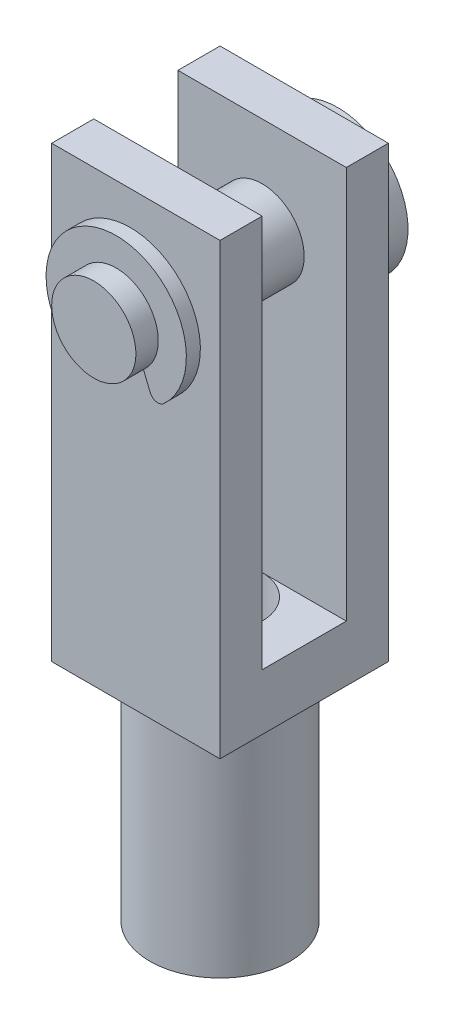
ISO-10303-21;
HEADER;
FILE_DESCRIPTION(('STEP AP214'),'2;1');
FILE_NAME('part.step','',(''),(''),'','','');
FILE_SCHEMA(('AUTOMOTIVE_DESIGN { 1 0 10303 214 1 1 1 1 }'));
ENDSEC;
DATA;
#1=APPLICATION_CONTEXT('core data for automotive mechanical design processes');
#2=APPLICATION_PROTOCOL_DEFINITION('international standard','automotive_design',2000,#1);
#3=PRODUCT_CONTEXT('',#1,'mechanical');
#4=PRODUCT('Part','Part','',(#3));
#5=PRODUCT_RELATED_PRODUCT_CATEGORY('part','',(#4));
#6=PRODUCT_DEFINITION_FORMATION('','',#4);
#7=PRODUCT_DEFINITION_CONTEXT('part definition',#1,'design');
#8=PRODUCT_DEFINITION('design','',#6,#7);
#9=PRODUCT_DEFINITION_SHAPE('','',#8);
#10=(LENGTH_UNIT() NAMED_UNIT(*) SI_UNIT(.MILLI.,.METRE.));
#11=(NAMED_UNIT(*) PLANE_ANGLE_UNIT() SI_UNIT($,.RADIAN.));
#12=(NAMED_UNIT(*) SI_UNIT($,.STERADIAN.) SOLID_ANGLE_UNIT());
#13=UNCERTAINTY_MEASURE_WITH_UNIT(LENGTH_MEASURE(1.E-05),#10,'distance_accuracy_value','');
#14=(GEOMETRIC_REPRESENTATION_CONTEXT(3) GLOBAL_UNCERTAINTY_ASSIGNED_CONTEXT((#13)) GLOBAL_UNIT_ASSIGNED_CONTEXT((#10,
#11,#12)) REPRESENTATION_CONTEXT('',''));
#15=CARTESIAN_POINT('',(0.,0.,0.));
#16=DIRECTION('',(0.,0.,1.));
#17=DIRECTION('',(1.,0.,0.));
#18=AXIS2_PLACEMENT_3D('',#15,#16,#17);
#19=CARTESIAN_POINT('',(1.48650456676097,10.8781787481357,3.7));
#20=DIRECTION('',(0.,0.,-1.));
#21=DIRECTION('',(-1.,0.,0.));
#22=AXIS2_PLACEMENT_3D('',#19,#20,#21);
#23=CYLINDRICAL_SURFACE('',#22,0.3);
#24=CARTESIAN_POINT('',(1.48650456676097,10.8781787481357,3.2));
#25=DIRECTION('',(0.,0.,1.));
#26=DIRECTION('',(1.,0.,0.));
#27=AXIS2_PLACEMENT_3D('',#24,#25,#26);
#28=CIRCLE('',#27,0.3);
#29=CARTESIAN_POINT('',(1.20843535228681,10.7655842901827,3.2));
#30=VERTEX_POINT('',#29);
#31=CARTESIAN_POINT('',(1.68920973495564,10.6570213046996,3.2));
#32=VERTEX_POINT('',#31);
#33=EDGE_CURVE('E127',#30,#32,#28,.T.);
#34=ORIENTED_EDGE('',*,*,#33,.T.);
#35=DIRECTION('',(0.,0.,-1.));
#36=VECTOR('',#35,1.);
#37=CARTESIAN_POINT('',(1.68920973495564,10.6570213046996,3.7));
#38=LINE('',#37,#36);
#39=CARTESIAN_POINT('',(1.68920973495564,10.6570213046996,3.7));
#40=VERTEX_POINT('',#39);
#41=EDGE_CURVE('E12',#40,#32,#38,.T.);
#42=ORIENTED_EDGE('',*,*,#41,.F.);
#43=CARTESIAN_POINT('',(1.48650456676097,10.8781787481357,3.7));
#44=DIRECTION('',(0.,0.,1.));
#45=DIRECTION('',(1.,0.,0.));
#46=AXIS2_PLACEMENT_3D('',#43,#44,#45);
#47=CIRCLE('',#46,0.3);
#48=CARTESIAN_POINT('',(1.20843535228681,10.7655842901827,3.7));
#49=VERTEX_POINT('',#48);
#50=EDGE_CURVE('E137',#49,#40,#47,.T.);
#51=ORIENTED_EDGE('',*,*,#50,.F.);
#52=DIRECTION('',(0.,0.,-1.));
#53=VECTOR('',#52,1.);
#54=CARTESIAN_POINT('',(1.20843535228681,10.7655842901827,3.7));
#55=LINE('',#54,#53);
#56=EDGE_CURVE('E123',#49,#30,#55,.T.);
#57=ORIENTED_EDGE('',*,*,#56,.T.);
#58=EDGE_LOOP('',(#34,#42,#51,#57));
#59=FACE_BOUND('',#58,.T.);
#60=ADVANCED_FACE('F43',(#59),#23,.T.);
#61=CARTESIAN_POINT('',(0.,12.5,3.7));
#62=DIRECTION('',(0.,0.,-1.));
#63=DIRECTION('',(-1.,0.,0.));
#64=AXIS2_PLACEMENT_3D('',#61,#62,#63);
#65=CYLINDRICAL_SURFACE('',#64,2.5);
#66=CARTESIAN_POINT('',(0.,12.5,3.2));
#67=DIRECTION('',(0.,0.,1.));
#68=DIRECTION('',(1.,0.,0.));
#69=AXIS2_PLACEMENT_3D('',#66,#67,#68);
#70=CIRCLE('',#69,2.5);
#71=CARTESIAN_POINT('',(-1.68920973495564,10.6570213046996,3.2));
#72=VERTEX_POINT('',#71);
#73=EDGE_CURVE('E130',#32,#72,#70,.T.);
#74=ORIENTED_EDGE('',*,*,#73,.T.);
#75=DIRECTION('',(0.,0.,-1.));
#76=VECTOR('',#75,1.);
#77=CARTESIAN_POINT('',(-1.68920973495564,10.6570213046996,3.7));
#78=LINE('',#77,#76);
#79=CARTESIAN_POINT('',(-1.68920973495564,10.6570213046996,3.7));
#80=VERTEX_POINT('',#79);
#81=EDGE_CURVE('E51',#80,#72,#78,.T.);
#82=ORIENTED_EDGE('',*,*,#81,.F.);
#83=CARTESIAN_POINT('',(0.,12.5,3.7));
#84=DIRECTION('',(0.,0.,1.));
#85=DIRECTION('',(1.,0.,0.));
#86=AXIS2_PLACEMENT_3D('',#83,#84,#85);
#87=CIRCLE('',#86,2.5);
#88=EDGE_CURVE('E96',#40,#80,#87,.T.);
#89=ORIENTED_EDGE('',*,*,#88,.F.);
#90=ORIENTED_EDGE('',*,*,#41,.T.);
#91=EDGE_LOOP('',(#74,#82,#89,#90));
#92=FACE_BOUND('',#91,.T.);
#93=ADVANCED_FACE('F161',(#92),#65,.T.);
#94=CARTESIAN_POINT('',(-1.48650456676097,10.8781787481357,3.7));
#95=DIRECTION('',(0.,0.,-1.));
#96=DIRECTION('',(-1.,0.,0.));
#97=AXIS2_PLACEMENT_3D('',#94,#95,#96);
#98=CYLINDRICAL_SURFACE('',#97,0.3);
#99=CARTESIAN_POINT('',(-1.48650456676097,10.8781787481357,3.2));
#100=DIRECTION('',(0.,0.,1.));
#101=DIRECTION('',(-1.,0.,0.));
#102=AXIS2_PLACEMENT_3D('',#99,#100,#101);
#103=CIRCLE('',#102,0.3);
#104=CARTESIAN_POINT('',(-1.2084353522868,10.7655842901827,3.2));
#105=VERTEX_POINT('',#104);
#106=EDGE_CURVE('E132',#72,#105,#103,.T.);
#107=ORIENTED_EDGE('',*,*,#106,.T.);
#108=DIRECTION('',(0.,0.,-1.));
#109=VECTOR('',#108,1.);
#110=CARTESIAN_POINT('',(-1.2084353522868,10.7655842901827,3.7));
#111=LINE('',#110,#109);
#112=CARTESIAN_POINT('',(-1.2084353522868,10.7655842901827,3.7));
#113=VERTEX_POINT('',#112);
#114=EDGE_CURVE('E118',#113,#105,#111,.T.);
#115=ORIENTED_EDGE('',*,*,#114,.F.);
#116=CARTESIAN_POINT('',(-1.48650456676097,10.8781787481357,3.7));
#117=DIRECTION('',(0.,0.,1.));
#118=DIRECTION('',(-1.,0.,0.));
#119=AXIS2_PLACEMENT_3D('',#116,#117,#118);
#120=CIRCLE('',#119,0.3);
#121=EDGE_CURVE('E109',#80,#113,#120,.T.);
#122=ORIENTED_EDGE('',*,*,#121,.F.);
#123=ORIENTED_EDGE('',*,*,#81,.T.);
#124=EDGE_LOOP('',(#107,#115,#122,#123));
#125=FACE_BOUND('',#124,.T.);
#126=ADVANCED_FACE('F143',(#125),#98,.T.);
#127=CARTESIAN_POINT('',(-0.86969590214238,11.6021531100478,3.7));
#128=DIRECTION('',(-0.92689738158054,0.375314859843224,0.));
#129=DIRECTION('',(-0.375314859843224,-0.92689738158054,0.));
#130=AXIS2_PLACEMENT_3D('',#127,#128,#129);
#131=PLANE('',#130);
#132=DIRECTION('',(0.375314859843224,0.92689738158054,0.));
#133=VECTOR('',#132,1.);
#134=CARTESIAN_POINT('',(-0.86969590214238,11.6021531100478,3.2));
#135=LINE('',#134,#133);
#136=CARTESIAN_POINT('',(-0.86969590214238,11.6021531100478,3.2));
#137=VERTEX_POINT('',#136);
#138=EDGE_CURVE('E117',#105,#137,#135,.T.);
#139=ORIENTED_EDGE('',*,*,#138,.T.);
#140=DIRECTION('',(0.,0.,-1.));
#141=VECTOR('',#140,1.);
#142=CARTESIAN_POINT('',(-0.86969590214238,11.6021531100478,3.7));
#143=LINE('',#142,#141);
#144=CARTESIAN_POINT('',(-0.86969590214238,11.6021531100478,3.7));
#145=VERTEX_POINT('',#144);
#146=EDGE_CURVE('E114',#145,#137,#143,.T.);
#147=ORIENTED_EDGE('',*,*,#146,.F.);
#148=DIRECTION('',(0.375314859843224,0.92689738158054,0.));
#149=VECTOR('',#148,1.);
#150=CARTESIAN_POINT('',(-0.86969590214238,11.6021531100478,3.7));
#151=LINE('',#150,#149);
#152=EDGE_CURVE('E103',#113,#145,#151,.T.);
#153=ORIENTED_EDGE('',*,*,#152,.F.);
#154=ORIENTED_EDGE('',*,*,#114,.T.);
#155=EDGE_LOOP('',(#139,#147,#153,#154));
#156=FACE_BOUND('',#155,.T.);
#157=ADVANCED_FACE('F115',(#156),#131,.F.);
#158=CARTESIAN_POINT('',(0.,12.5,3.7));
#159=DIRECTION('',(0.,0.,-1.));
#160=DIRECTION('',(-1.,0.,0.));
#161=AXIS2_PLACEMENT_3D('',#158,#159,#160);
#162=CYLINDRICAL_SURFACE('',#161,1.25);
#163=CARTESIAN_POINT('',(0.,12.5,3.2));
#164=DIRECTION('',(0.,0.,-1.));
#165=DIRECTION('',(1.,0.,0.));
#166=AXIS2_PLACEMENT_3D('',#163,#164,#165);
#167=CIRCLE('',#166,1.25);
#168=CARTESIAN_POINT('',(0.86969590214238,11.6021531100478,3.2));
#169=VERTEX_POINT('',#168);
#170=EDGE_CURVE('E82',#137,#169,#167,.T.);
#171=ORIENTED_EDGE('',*,*,#170,.T.);
#172=DIRECTION('',(0.,0.,-1.));
#173=VECTOR('',#172,1.);
#174=CARTESIAN_POINT('',(0.86969590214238,11.6021531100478,3.7));
#175=LINE('',#174,#173);
#176=CARTESIAN_POINT('',(0.86969590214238,11.6021531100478,3.7));
#177=VERTEX_POINT('',#176);
#178=EDGE_CURVE('E119',#177,#169,#175,.T.);
#179=ORIENTED_EDGE('',*,*,#178,.F.);
#180=CARTESIAN_POINT('',(0.,12.5,3.7));
#181=DIRECTION('',(0.,0.,-1.));
#182=DIRECTION('',(1.,0.,0.));
#183=AXIS2_PLACEMENT_3D('',#180,#181,#182);
#184=CIRCLE('',#183,1.25);
#185=EDGE_CURVE('E107',#145,#177,#184,.T.);
#186=ORIENTED_EDGE('',*,*,#185,.F.);
#187=ORIENTED_EDGE('',*,*,#146,.T.);
#188=EDGE_LOOP('',(#171,#179,#186,#187));
#189=FACE_BOUND('',#188,.T.);
#190=ADVANCED_FACE('F121',(#189),#162,.F.);
#191=CARTESIAN_POINT('',(0.86969590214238,11.6021531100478,3.7));
#192=DIRECTION('',(0.92689738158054,0.375314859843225,0.));
#193=DIRECTION('',(-0.375314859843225,0.92689738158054,0.));
#194=AXIS2_PLACEMENT_3D('',#191,#192,#193);
#195=PLANE('',#194);
#196=DIRECTION('',(0.375314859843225,-0.92689738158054,0.));
#197=VECTOR('',#196,1.);
#198=CARTESIAN_POINT('',(0.86969590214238,11.6021531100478,3.2));
#199=LINE('',#198,#197);
#200=EDGE_CURVE('E88',#169,#30,#199,.T.);
#201=ORIENTED_EDGE('',*,*,#200,.T.);
#202=ORIENTED_EDGE('',*,*,#56,.F.);
#203=DIRECTION('',(0.375314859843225,-0.92689738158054,0.));
#204=VECTOR('',#203,1.);
#205=CARTESIAN_POINT('',(0.86969590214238,11.6021531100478,3.7));
#206=LINE('',#205,#204);
#207=EDGE_CURVE('E59',#177,#49,#206,.T.);
#208=ORIENTED_EDGE('',*,*,#207,.F.);
#209=ORIENTED_EDGE('',*,*,#178,.T.);
#210=EDGE_LOOP('',(#201,#202,#208,#209));
#211=FACE_BOUND('',#210,.T.);
#212=ADVANCED_FACE('F150',(#211),#195,.F.);
#213=CARTESIAN_POINT('',(1.48650456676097,10.8781787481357,3.7));
#214=DIRECTION('',(0.,0.,1.));
#215=DIRECTION('',(1.,0.,0.));
#216=AXIS2_PLACEMENT_3D('',#213,#214,#215);
#217=PLANE('',#216);
#218=ORIENTED_EDGE('',*,*,#50,.T.);
#219=ORIENTED_EDGE('',*,*,#88,.T.);
#220=ORIENTED_EDGE('',*,*,#121,.T.);
#221=ORIENTED_EDGE('',*,*,#152,.T.);
#222=ORIENTED_EDGE('',*,*,#185,.T.);
#223=ORIENTED_EDGE('',*,*,#207,.T.);
#224=EDGE_LOOP('',(#218,#219,#220,#221,#222,#223));
#225=FACE_BOUND('',#224,.T.);
#226=ADVANCED_FACE('F105',(#225),#217,.T.);
#227=CARTESIAN_POINT('',(1.48650456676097,10.8781787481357,3.2));
#228=DIRECTION('',(0.,0.,1.));
#229=DIRECTION('',(1.,0.,0.));
#230=AXIS2_PLACEMENT_3D('',#227,#228,#229);
#231=PLANE('',#230);
#232=ORIENTED_EDGE('',*,*,#33,.F.);
#233=ORIENTED_EDGE('',*,*,#200,.F.);
#234=ORIENTED_EDGE('',*,*,#170,.F.);
#235=ORIENTED_EDGE('',*,*,#138,.F.);
#236=ORIENTED_EDGE('',*,*,#106,.F.);
#237=ORIENTED_EDGE('',*,*,#73,.F.);
#238=EDGE_LOOP('',(#232,#233,#234,#235,#236,#237));
#239=FACE_BOUND('',#238,.T.);
#240=ADVANCED_FACE('F146',(#239),#231,.F.);
#241=CLOSED_SHELL('',(#60,#93,#126,#157,#190,#212,#226,#240));
#242=MANIFOLD_SOLID_BREP('B2',#241);
#243=CARTESIAN_POINT('',(0.,12.5,4.5));
#244=DIRECTION('',(0.,0.,-1.));
#245=DIRECTION('',(-1.,0.,0.));
#246=AXIS2_PLACEMENT_3D('',#243,#244,#245);
#247=CYLINDRICAL_SURFACE('',#246,1.5);
#248=CARTESIAN_POINT('',(0.,12.5,4.5));
#249=DIRECTION('',(0.,0.,-1.));
#250=DIRECTION('',(-1.,0.,0.));
#251=AXIS2_PLACEMENT_3D('',#248,#249,#250);
#252=CIRCLE('',#251,1.5);
#253=CARTESIAN_POINT('',(-1.5,12.5,4.5));
#254=VERTEX_POINT('',#253);
#255=EDGE_CURVE('E42',#254,#254,#252,.T.);
#256=ORIENTED_EDGE('',*,*,#255,.T.);
#257=EDGE_LOOP('',(#256));
#258=FACE_BOUND('',#257,.T.);
#259=CARTESIAN_POINT('',(0.,12.5,-3.));
#260=DIRECTION('',(0.,0.,-1.));
#261=DIRECTION('',(-1.,0.,0.));
#262=AXIS2_PLACEMENT_3D('',#259,#260,#261);
#263=CIRCLE('',#262,1.5);
#264=CARTESIAN_POINT('',(-1.5,12.5,-3.));
#265=VERTEX_POINT('',#264);
#266=EDGE_CURVE('E230',#265,#265,#263,.T.);
#267=ORIENTED_EDGE('',*,*,#266,.F.);
#268=EDGE_LOOP('',(#267));
#269=FACE_BOUND('',#268,.T.);
#270=ADVANCED_FACE('F227',(#258,#269),#247,.T.);
#271=CARTESIAN_POINT('',(0.,12.5,4.5));
#272=DIRECTION('',(0.,0.,-1.));
#273=DIRECTION('',(-1.,0.,0.));
#274=AXIS2_PLACEMENT_3D('',#271,#272,#273);
#275=PLANE('',#274);
#276=ORIENTED_EDGE('',*,*,#255,.F.);
#277=EDGE_LOOP('',(#276));
#278=FACE_BOUND('',#277,.T.);
#279=ADVANCED_FACE('F250',(#278),#275,.F.);
#280=CARTESIAN_POINT('',(0.,12.5,-4.2));
#281=DIRECTION('',(0.,0.,1.));
#282=DIRECTION('',(1.,0.,0.));
#283=AXIS2_PLACEMENT_3D('',#280,#281,#282);
#284=CYLINDRICAL_SURFACE('',#283,2.5);
#285=CARTESIAN_POINT('',(0.,12.5,-4.2));
#286=DIRECTION('',(0.,0.,-1.));
#287=DIRECTION('',(-1.,0.,0.));
#288=AXIS2_PLACEMENT_3D('',#285,#286,#287);
#289=CIRCLE('',#288,2.5);
#290=CARTESIAN_POINT('',(-2.5,12.5,-4.2));
#291=VERTEX_POINT('',#290);
#292=EDGE_CURVE('E237',#291,#291,#289,.T.);
#293=ORIENTED_EDGE('',*,*,#292,.F.);
#294=EDGE_LOOP('',(#293));
#295=FACE_BOUND('',#294,.T.);
#296=CARTESIAN_POINT('',(0.,12.5,-3.));
#297=DIRECTION('',(0.,0.,-1.));
#298=DIRECTION('',(-1.,0.,0.));
#299=AXIS2_PLACEMENT_3D('',#296,#297,#298);
#300=CIRCLE('',#299,2.5);
#301=CARTESIAN_POINT('',(-2.5,12.5,-3.));
#302=VERTEX_POINT('',#301);
#303=EDGE_CURVE('E239',#302,#302,#300,.T.);
#304=ORIENTED_EDGE('',*,*,#303,.T.);
#305=EDGE_LOOP('',(#304));
#306=FACE_BOUND('',#305,.T.);
#307=ADVANCED_FACE('F247',(#295,#306),#284,.T.);
#308=CARTESIAN_POINT('',(0.,12.5,-4.2));
#309=DIRECTION('',(0.,0.,-1.));
#310=DIRECTION('',(-1.,0.,0.));
#311=AXIS2_PLACEMENT_3D('',#308,#309,#310);
#312=PLANE('',#311);
#313=ORIENTED_EDGE('',*,*,#292,.T.);
#314=EDGE_LOOP('',(#313));
#315=FACE_BOUND('',#314,.T.);
#316=ADVANCED_FACE('F245',(#315),#312,.T.);
#317=CARTESIAN_POINT('',(0.,12.5,-3.));
#318=DIRECTION('',(0.,0.,-1.));
#319=DIRECTION('',(-1.,0.,0.));
#320=AXIS2_PLACEMENT_3D('',#317,#318,#319);
#321=PLANE('',#320);
#322=ORIENTED_EDGE('',*,*,#266,.T.);
#323=EDGE_LOOP('',(#322));
#324=FACE_BOUND('',#323,.T.);
#325=ORIENTED_EDGE('',*,*,#303,.F.);
#326=EDGE_LOOP('',(#325));
#327=FACE_BOUND('',#326,.T.);
#328=ADVANCED_FACE('F254',(#324,#327),#321,.F.);
#329=CLOSED_SHELL('',(#270,#279,#307,#316,#328));
#330=MANIFOLD_SOLID_BREP('B6',#329);
#331=CARTESIAN_POINT('',(-3.,2.,1.5));
#332=DIRECTION('',(0.,-1.,0.));
#333=DIRECTION('',(0.,0.,-1.));
#334=AXIS2_PLACEMENT_3D('',#331,#332,#333);
#335=PLANE('',#334);
#336=DIRECTION('',(1.,0.,0.));
#337=VECTOR('',#336,1.);
#338=CARTESIAN_POINT('',(-3.,2.,-1.5));
#339=LINE('',#338,#337);
#340=CARTESIAN_POINT('',(0.,2.,-1.5));
#341=VERTEX_POINT('',#340);
#342=CARTESIAN_POINT('',(3.,2.,-1.5));
#343=VERTEX_POINT('',#342);
#344=EDGE_CURVE('E376',#341,#343,#339,.T.);
#345=ORIENTED_EDGE('',*,*,#344,.F.);
#346=CARTESIAN_POINT('',(0.,2.,0.));
#347=DIRECTION('',(0.,-1.,0.));
#348=DIRECTION('',(0.,0.,-1.));
#349=AXIS2_PLACEMENT_3D('',#346,#347,#348);
#350=CIRCLE('',#349,1.5);
#351=CARTESIAN_POINT('',(0.,2.,1.5));
#352=VERTEX_POINT('',#351);
#353=EDGE_CURVE('E225',#341,#352,#350,.T.);
#354=ORIENTED_EDGE('',*,*,#353,.T.);
#355=DIRECTION('',(1.,0.,0.));
#356=VECTOR('',#355,1.);
#357=CARTESIAN_POINT('',(-3.,2.,1.5));
#358=LINE('',#357,#356);
#359=CARTESIAN_POINT('',(3.,2.,1.5));
#360=VERTEX_POINT('',#359);
#361=EDGE_CURVE('E374',#352,#360,#358,.T.);
#362=ORIENTED_EDGE('',*,*,#361,.T.);
#363=DIRECTION('',(0.,0.,-1.));
#364=VECTOR('',#363,1.);
#365=CARTESIAN_POINT('',(3.,2.,1.5));
#366=LINE('',#365,#364);
#367=EDGE_CURVE('E455',#360,#343,#366,.T.);
#368=ORIENTED_EDGE('',*,*,#367,.T.);
#369=EDGE_LOOP('',(#345,#354,#362,#368));
#370=FACE_BOUND('',#369,.T.);
#371=ADVANCED_FACE('F297',(#370),#335,.F.);
#372=CARTESIAN_POINT('',(0.,16.,0.));
#373=DIRECTION('',(0.,1.,0.));
#374=DIRECTION('',(0.,0.,1.));
#375=AXIS2_PLACEMENT_3D('',#372,#373,#374);
#376=PLANE('',#375);
#377=DIRECTION('',(1.,0.,0.));
#378=VECTOR('',#377,1.);
#379=CARTESIAN_POINT('',(-3.,16.,1.5));
#380=LINE('',#379,#378);
#381=CARTESIAN_POINT('',(-3.,16.,1.5));
#382=VERTEX_POINT('',#381);
#383=CARTESIAN_POINT('',(3.,16.,1.5));
#384=VERTEX_POINT('',#383);
#385=EDGE_CURVE('E399',#382,#384,#380,.T.);
#386=ORIENTED_EDGE('',*,*,#385,.F.);
#387=DIRECTION('',(0.,0.,1.));
#388=VECTOR('',#387,1.);
#389=CARTESIAN_POINT('',(-3.,16.,-3.));
#390=LINE('',#389,#388);
#391=CARTESIAN_POINT('',(-3.,16.,3.));
#392=VERTEX_POINT('',#391);
#393=EDGE_CURVE('E406',#382,#392,#390,.T.);
#394=ORIENTED_EDGE('',*,*,#393,.T.);
#395=DIRECTION('',(1.,0.,0.));
#396=VECTOR('',#395,1.);
#397=CARTESIAN_POINT('',(-3.,16.,3.));
#398=LINE('',#397,#396);
#399=CARTESIAN_POINT('',(3.,16.,3.));
#400=VERTEX_POINT('',#399);
#401=EDGE_CURVE('E410',#392,#400,#398,.T.);
#402=ORIENTED_EDGE('',*,*,#401,.T.);
#403=DIRECTION('',(0.,0.,-1.));
#404=VECTOR('',#403,1.);
#405=CARTESIAN_POINT('',(3.,16.,-3.));
#406=LINE('',#405,#404);
#407=EDGE_CURVE('E400',#400,#384,#406,.T.);
#408=ORIENTED_EDGE('',*,*,#407,.T.);
#409=EDGE_LOOP('',(#386,#394,#402,#408));
#410=FACE_BOUND('',#409,.T.);
#411=ADVANCED_FACE('F470',(#410),#376,.T.);
#412=CARTESIAN_POINT('',(0.,0.,0.));
#413=DIRECTION('',(0.,1.,0.));
#414=DIRECTION('',(0.,0.,1.));
#415=AXIS2_PLACEMENT_3D('',#412,#413,#414);
#416=PLANE('',#415);
#417=DIRECTION('',(0.,0.,-1.));
#418=VECTOR('',#417,1.);
#419=CARTESIAN_POINT('',(3.,0.,-3.));
#420=LINE('',#419,#418);
#421=CARTESIAN_POINT('',(3.,0.,3.));
#422=VERTEX_POINT('',#421);
#423=CARTESIAN_POINT('',(3.,0.,-3.));
#424=VERTEX_POINT('',#423);
#425=EDGE_CURVE('E398',#422,#424,#420,.T.);
#426=ORIENTED_EDGE('',*,*,#425,.F.);
#427=DIRECTION('',(1.,0.,0.));
#428=VECTOR('',#427,1.);
#429=CARTESIAN_POINT('',(-3.,0.,3.));
#430=LINE('',#429,#428);
#431=CARTESIAN_POINT('',(-3.,0.,3.));
#432=VERTEX_POINT('',#431);
#433=EDGE_CURVE('E419',#432,#422,#430,.T.);
#434=ORIENTED_EDGE('',*,*,#433,.F.);
#435=DIRECTION('',(0.,0.,1.));
#436=VECTOR('',#435,1.);
#437=CARTESIAN_POINT('',(-3.,0.,-3.));
#438=LINE('',#437,#436);
#439=CARTESIAN_POINT('',(-3.,0.,-3.));
#440=VERTEX_POINT('',#439);
#441=EDGE_CURVE('E417',#440,#432,#438,.T.);
#442=ORIENTED_EDGE('',*,*,#441,.F.);
#443=DIRECTION('',(-1.,0.,0.));
#444=VECTOR('',#443,1.);
#445=CARTESIAN_POINT('',(-3.,0.,-3.));
#446=LINE('',#445,#444);
#447=EDGE_CURVE('E415',#424,#440,#446,.T.);
#448=ORIENTED_EDGE('',*,*,#447,.F.);
#449=EDGE_LOOP('',(#426,#434,#442,#448));
#450=FACE_BOUND('',#449,.T.);
#451=CARTESIAN_POINT('',(0.,0.,0.));
#452=DIRECTION('',(0.,1.,0.));
#453=DIRECTION('',(0.,0.,1.));
#454=AXIS2_PLACEMENT_3D('',#451,#452,#453);
#455=CIRCLE('',#454,2.5);
#456=CARTESIAN_POINT('',(0.,0.,2.5));
#457=VERTEX_POINT('',#456);
#458=EDGE_CURVE('E305',#457,#457,#455,.F.);
#459=ORIENTED_EDGE('',*,*,#458,.F.);
#460=EDGE_LOOP('',(#459));
#461=FACE_BOUND('',#460,.T.);
#462=ADVANCED_FACE('F485',(#450,#461),#416,.F.);
#463=CARTESIAN_POINT('',(3.,16.,-3.));
#464=DIRECTION('',(-1.,0.,0.));
#465=DIRECTION('',(0.,0.,1.));
#466=AXIS2_PLACEMENT_3D('',#463,#464,#465);
#467=PLANE('',#466);
#468=ORIENTED_EDGE('',*,*,#367,.F.);
#469=DIRECTION('',(0.,-1.,0.));
#470=VECTOR('',#469,1.);
#471=CARTESIAN_POINT('',(3.,16.,1.5));
#472=LINE('',#471,#470);
#473=EDGE_CURVE('E383',#384,#360,#472,.T.);
#474=ORIENTED_EDGE('',*,*,#473,.F.);
#475=ORIENTED_EDGE('',*,*,#407,.F.);
#476=DIRECTION('',(0.,-1.,0.));
#477=VECTOR('',#476,1.);
#478=CARTESIAN_POINT('',(3.,16.,3.));
#479=LINE('',#478,#477);
#480=EDGE_CURVE('E412',#400,#422,#479,.T.);
#481=ORIENTED_EDGE('',*,*,#480,.T.);
#482=ORIENTED_EDGE('',*,*,#425,.T.);
#483=DIRECTION('',(0.,-1.,0.));
#484=VECTOR('',#483,1.);
#485=CARTESIAN_POINT('',(3.,16.,-3.));
#486=LINE('',#485,#484);
#487=CARTESIAN_POINT('',(3.,16.,-3.));
#488=VERTEX_POINT('',#487);
#489=EDGE_CURVE('E429',#488,#424,#486,.T.);
#490=ORIENTED_EDGE('',*,*,#489,.F.);
#491=CARTESIAN_POINT('',(3.,16.,-1.5));
#492=VERTEX_POINT('',#491);
#493=EDGE_CURVE('E404',#492,#488,#406,.T.);
#494=ORIENTED_EDGE('',*,*,#493,.F.);
#495=DIRECTION('',(0.,1.,0.));
#496=VECTOR('',#495,1.);
#497=CARTESIAN_POINT('',(3.,16.,-1.5));
#498=LINE('',#497,#496);
#499=EDGE_CURVE('E317',#343,#492,#498,.T.);
#500=ORIENTED_EDGE('',*,*,#499,.F.);
#501=EDGE_LOOP('',(#468,#474,#475,#481,#482,#490,#494,#500));
#502=FACE_BOUND('',#501,.T.);
#503=ADVANCED_FACE('F299',(#502),#467,.F.);
#504=CARTESIAN_POINT('',(-3.,16.,-3.));
#505=DIRECTION('',(0.,0.,1.));
#506=DIRECTION('',(1.,0.,0.));
#507=AXIS2_PLACEMENT_3D('',#504,#505,#506);
#508=PLANE('',#507);
#509=CARTESIAN_POINT('',(0.,12.5,-3.));
#510=DIRECTION('',(0.,0.,-1.));
#511=DIRECTION('',(-1.,0.,0.));
#512=AXIS2_PLACEMENT_3D('',#509,#510,#511);
#513=CIRCLE('',#512,1.5);
#514=CARTESIAN_POINT('',(-1.5,12.5,-3.));
#515=VERTEX_POINT('',#514);
#516=EDGE_CURVE('E368',#515,#515,#513,.T.);
#517=ORIENTED_EDGE('',*,*,#516,.F.);
#518=EDGE_LOOP('',(#517));
#519=FACE_BOUND('',#518,.T.);
#520=ORIENTED_EDGE('',*,*,#447,.T.);
#521=DIRECTION('',(0.,-1.,0.));
#522=VECTOR('',#521,1.);
#523=CARTESIAN_POINT('',(-3.,16.,-3.));
#524=LINE('',#523,#522);
#525=CARTESIAN_POINT('',(-3.,16.,-3.));
#526=VERTEX_POINT('',#525);
#527=EDGE_CURVE('E426',#526,#440,#524,.T.);
#528=ORIENTED_EDGE('',*,*,#527,.F.);
#529=DIRECTION('',(-1.,0.,0.));
#530=VECTOR('',#529,1.);
#531=CARTESIAN_POINT('',(-3.,16.,-3.));
#532=LINE('',#531,#530);
#533=EDGE_CURVE('E403',#488,#526,#532,.T.);
#534=ORIENTED_EDGE('',*,*,#533,.F.);
#535=ORIENTED_EDGE('',*,*,#489,.T.);
#536=EDGE_LOOP('',(#520,#528,#534,#535));
#537=FACE_BOUND('',#536,.T.);
#538=ADVANCED_FACE('F481',(#519,#537),#508,.F.);
#539=CARTESIAN_POINT('',(-3.,16.,-3.));
#540=DIRECTION('',(1.,0.,0.));
#541=DIRECTION('',(0.,0.,-1.));
#542=AXIS2_PLACEMENT_3D('',#539,#540,#541);
#543=PLANE('',#542);
#544=ORIENTED_EDGE('',*,*,#393,.F.);
#545=DIRECTION('',(0.,-1.,0.));
#546=VECTOR('',#545,1.);
#547=CARTESIAN_POINT('',(-3.,16.,1.5));
#548=LINE('',#547,#546);
#549=CARTESIAN_POINT('',(-3.,2.,1.5));
#550=VERTEX_POINT('',#549);
#551=EDGE_CURVE('E449',#382,#550,#548,.T.);
#552=ORIENTED_EDGE('',*,*,#551,.T.);
#553=DIRECTION('',(0.,0.,-1.));
#554=VECTOR('',#553,1.);
#555=CARTESIAN_POINT('',(-3.,2.,1.5));
#556=LINE('',#555,#554);
#557=CARTESIAN_POINT('',(-3.,2.,-1.5));
#558=VERTEX_POINT('',#557);
#559=EDGE_CURVE('E389',#550,#558,#556,.T.);
#560=ORIENTED_EDGE('',*,*,#559,.T.);
#561=DIRECTION('',(0.,1.,0.));
#562=VECTOR('',#561,1.);
#563=CARTESIAN_POINT('',(-3.,16.,-1.5));
#564=LINE('',#563,#562);
#565=CARTESIAN_POINT('',(-3.,16.,-1.5));
#566=VERTEX_POINT('',#565);
#567=EDGE_CURVE('E385',#558,#566,#564,.T.);
#568=ORIENTED_EDGE('',*,*,#567,.T.);
#569=EDGE_CURVE('E407',#526,#566,#390,.T.);
#570=ORIENTED_EDGE('',*,*,#569,.F.);
#571=ORIENTED_EDGE('',*,*,#527,.T.);
#572=ORIENTED_EDGE('',*,*,#441,.T.);
#573=DIRECTION('',(0.,-1.,0.));
#574=VECTOR('',#573,1.);
#575=CARTESIAN_POINT('',(-3.,16.,3.));
#576=LINE('',#575,#574);
#577=EDGE_CURVE('E423',#392,#432,#576,.T.);
#578=ORIENTED_EDGE('',*,*,#577,.F.);
#579=EDGE_LOOP('',(#544,#552,#560,#568,#570,#571,#572,#578));
#580=FACE_BOUND('',#579,.T.);
#581=ADVANCED_FACE('F466',(#580),#543,.F.);
#582=CARTESIAN_POINT('',(-3.,16.,3.));
#583=DIRECTION('',(0.,0.,-1.));
#584=DIRECTION('',(-1.,0.,0.));
#585=AXIS2_PLACEMENT_3D('',#582,#583,#584);
#586=PLANE('',#585);
#587=CARTESIAN_POINT('',(0.,12.5,3.));
#588=DIRECTION('',(0.,0.,-1.));
#589=DIRECTION('',(-1.,0.,0.));
#590=AXIS2_PLACEMENT_3D('',#587,#588,#589);
#591=CIRCLE('',#590,1.5);
#592=CARTESIAN_POINT('',(-1.5,12.5,3.));
#593=VERTEX_POINT('',#592);
#594=EDGE_CURVE('E436',#593,#593,#591,.T.);
#595=ORIENTED_EDGE('',*,*,#594,.T.);
#596=EDGE_LOOP('',(#595));
#597=FACE_BOUND('',#596,.T.);
#598=ORIENTED_EDGE('',*,*,#433,.T.);
#599=ORIENTED_EDGE('',*,*,#480,.F.);
#600=ORIENTED_EDGE('',*,*,#401,.F.);
#601=ORIENTED_EDGE('',*,*,#577,.T.);
#602=EDGE_LOOP('',(#598,#599,#600,#601));
#603=FACE_BOUND('',#602,.T.);
#604=ADVANCED_FACE('F488',(#597,#603),#586,.F.);
#605=DIRECTION('',(1.,0.,0.));
#606=VECTOR('',#605,1.);
#607=CARTESIAN_POINT('',(-3.,16.,-1.5));
#608=LINE('',#607,#606);
#609=EDGE_CURVE('E458',#566,#492,#608,.T.);
#610=ORIENTED_EDGE('',*,*,#609,.T.);
#611=ORIENTED_EDGE('',*,*,#493,.T.);
#612=ORIENTED_EDGE('',*,*,#533,.T.);
#613=ORIENTED_EDGE('',*,*,#569,.T.);
#614=EDGE_LOOP('',(#610,#611,#612,#613));
#615=FACE_BOUND('',#614,.T.);
#616=ADVANCED_FACE('F478',(#615),#376,.T.);
#617=CARTESIAN_POINT('',(0.,-8.,0.));
#618=DIRECTION('',(0.,1.,0.));
#619=DIRECTION('',(0.,0.,1.));
#620=AXIS2_PLACEMENT_3D('',#617,#618,#619);
#621=CYLINDRICAL_SURFACE('',#620,2.5);
#622=CARTESIAN_POINT('',(0.,-8.,0.));
#623=DIRECTION('',(0.,-1.,0.));
#624=DIRECTION('',(0.,0.,-1.));
#625=AXIS2_PLACEMENT_3D('',#622,#623,#624);
#626=CIRCLE('',#625,2.5);
#627=CARTESIAN_POINT('',(0.,-8.,-2.5));
#628=VERTEX_POINT('',#627);
#629=EDGE_CURVE('E395',#628,#628,#626,.T.);
#630=ORIENTED_EDGE('',*,*,#629,.F.);
#631=EDGE_LOOP('',(#630));
#632=FACE_BOUND('',#631,.T.);
#633=ORIENTED_EDGE('',*,*,#458,.T.);
#634=EDGE_LOOP('',(#633));
#635=FACE_BOUND('',#634,.T.);
#636=ADVANCED_FACE('F495',(#632,#635),#621,.T.);
#637=CARTESIAN_POINT('',(0.,-8.,0.));
#638=DIRECTION('',(0.,-1.,0.));
#639=DIRECTION('',(0.,0.,-1.));
#640=AXIS2_PLACEMENT_3D('',#637,#638,#639);
#641=PLANE('',#640);
#642=CARTESIAN_POINT('',(0.,-8.,0.));
#643=DIRECTION('',(0.,-1.,0.));
#644=DIRECTION('',(0.,0.,-1.));
#645=AXIS2_PLACEMENT_3D('',#642,#643,#644);
#646=CIRCLE('',#645,1.5);
#647=CARTESIAN_POINT('',(0.,-8.,-1.5));
#648=VERTEX_POINT('',#647);
#649=EDGE_CURVE('E369',#648,#648,#646,.T.);
#650=ORIENTED_EDGE('',*,*,#649,.F.);
#651=EDGE_LOOP('',(#650));
#652=FACE_BOUND('',#651,.T.);
#653=ORIENTED_EDGE('',*,*,#629,.T.);
#654=EDGE_LOOP('',(#653));
#655=FACE_BOUND('',#654,.T.);
#656=ADVANCED_FACE('F518',(#652,#655),#641,.T.);
#657=CARTESIAN_POINT('',(-3.,16.,1.5));
#658=DIRECTION('',(0.,0.,1.));
#659=DIRECTION('',(0.,-1.,0.));
#660=AXIS2_PLACEMENT_3D('',#657,#658,#659);
#661=PLANE('',#660);
#662=CARTESIAN_POINT('',(0.,12.5,1.5));
#663=DIRECTION('',(0.,0.,1.));
#664=DIRECTION('',(0.,-1.,0.));
#665=AXIS2_PLACEMENT_3D('',#662,#663,#664);
#666=CIRCLE('',#665,1.5);
#667=CARTESIAN_POINT('',(0.,11.,1.5));
#668=VERTEX_POINT('',#667);
#669=EDGE_CURVE('E435',#668,#668,#666,.T.);
#670=ORIENTED_EDGE('',*,*,#669,.T.);
#671=EDGE_LOOP('',(#670));
#672=FACE_BOUND('',#671,.T.);
#673=ORIENTED_EDGE('',*,*,#473,.T.);
#674=ORIENTED_EDGE('',*,*,#361,.F.);
#675=EDGE_CURVE('E380',#550,#352,#358,.T.);
#676=ORIENTED_EDGE('',*,*,#675,.F.);
#677=ORIENTED_EDGE('',*,*,#551,.F.);
#678=ORIENTED_EDGE('',*,*,#385,.T.);
#679=EDGE_LOOP('',(#673,#674,#676,#677,#678));
#680=FACE_BOUND('',#679,.T.);
#681=ADVANCED_FACE('F379',(#672,#680),#661,.F.);
#682=CARTESIAN_POINT('',(-3.,16.,-1.5));
#683=DIRECTION('',(0.,0.,-1.));
#684=DIRECTION('',(0.,1.,0.));
#685=AXIS2_PLACEMENT_3D('',#682,#683,#684);
#686=PLANE('',#685);
#687=CARTESIAN_POINT('',(0.,12.5,-1.5));
#688=DIRECTION('',(0.,0.,-1.));
#689=DIRECTION('',(0.,1.,0.));
#690=AXIS2_PLACEMENT_3D('',#687,#688,#689);
#691=CIRCLE('',#690,1.5);
#692=CARTESIAN_POINT('',(0.,14.,-1.5));
#693=VERTEX_POINT('',#692);
#694=EDGE_CURVE('E433',#693,#693,#691,.T.);
#695=ORIENTED_EDGE('',*,*,#694,.T.);
#696=EDGE_LOOP('',(#695));
#697=FACE_BOUND('',#696,.T.);
#698=ORIENTED_EDGE('',*,*,#499,.T.);
#699=ORIENTED_EDGE('',*,*,#609,.F.);
#700=ORIENTED_EDGE('',*,*,#567,.F.);
#701=EDGE_CURVE('E391',#558,#341,#339,.T.);
#702=ORIENTED_EDGE('',*,*,#701,.T.);
#703=ORIENTED_EDGE('',*,*,#344,.T.);
#704=EDGE_LOOP('',(#698,#699,#700,#702,#703));
#705=FACE_BOUND('',#704,.T.);
#706=ADVANCED_FACE('F462',(#697,#705),#686,.F.);
#707=ORIENTED_EDGE('',*,*,#675,.T.);
#708=CARTESIAN_POINT('',(0.,2.,0.));
#709=DIRECTION('',(0.,-1.,0.));
#710=DIRECTION('',(0.,0.,-1.));
#711=AXIS2_PLACEMENT_3D('',#708,#709,#710);
#712=CIRCLE('',#711,1.5);
#713=EDGE_CURVE('E363',#341,#352,#712,.F.);
#714=ORIENTED_EDGE('',*,*,#713,.F.);
#715=ORIENTED_EDGE('',*,*,#701,.F.);
#716=ORIENTED_EDGE('',*,*,#559,.F.);
#717=EDGE_LOOP('',(#707,#714,#715,#716));
#718=FACE_BOUND('',#717,.T.);
#719=ADVANCED_FACE('F387',(#718),#335,.F.);
#720=CARTESIAN_POINT('',(0.,12.5,3.));
#721=DIRECTION('',(0.,0.,-1.));
#722=DIRECTION('',(-1.,0.,0.));
#723=AXIS2_PLACEMENT_3D('',#720,#721,#722);
#724=CYLINDRICAL_SURFACE('',#723,1.5);
#725=ORIENTED_EDGE('',*,*,#516,.T.);
#726=EDGE_LOOP('',(#725));
#727=FACE_BOUND('',#726,.T.);
#728=ORIENTED_EDGE('',*,*,#694,.F.);
#729=EDGE_LOOP('',(#728));
#730=FACE_BOUND('',#729,.T.);
#731=ADVANCED_FACE('F507',(#727,#730),#724,.F.);
#732=ORIENTED_EDGE('',*,*,#594,.F.);
#733=EDGE_LOOP('',(#732));
#734=FACE_BOUND('',#733,.T.);
#735=ORIENTED_EDGE('',*,*,#669,.F.);
#736=EDGE_LOOP('',(#735));
#737=FACE_BOUND('',#736,.T.);
#738=ADVANCED_FACE('F512',(#734,#737),#724,.F.);
#739=CARTESIAN_POINT('',(0.,16.001,0.));
#740=DIRECTION('',(0.,-1.,0.));
#741=DIRECTION('',(0.,0.,-1.));
#742=AXIS2_PLACEMENT_3D('',#739,#740,#741);
#743=CYLINDRICAL_SURFACE('',#742,1.5);
#744=ORIENTED_EDGE('',*,*,#649,.T.);
#745=EDGE_LOOP('',(#744));
#746=FACE_BOUND('',#745,.T.);
#747=ORIENTED_EDGE('',*,*,#713,.T.);
#748=ORIENTED_EDGE('',*,*,#353,.F.);
#749=EDGE_LOOP('',(#747,#748));
#750=FACE_BOUND('',#749,.T.);
#751=ADVANCED_FACE('F364',(#746,#750),#743,.F.);
#752=CLOSED_SHELL('',(#371,#411,#462,#503,#538,#581,#604,#616,#636,#656,#681,#706,#719,#731,
#738,#751));
#753=MANIFOLD_SOLID_BREP('B37',#752);
#754=ADVANCED_BREP_SHAPE_REPRESENTATION('',(#18,#242,#330,#753),#14);
#755=SHAPE_DEFINITION_REPRESENTATION(#9,#754);
ENDSEC;
END-ISO-10303-21;
